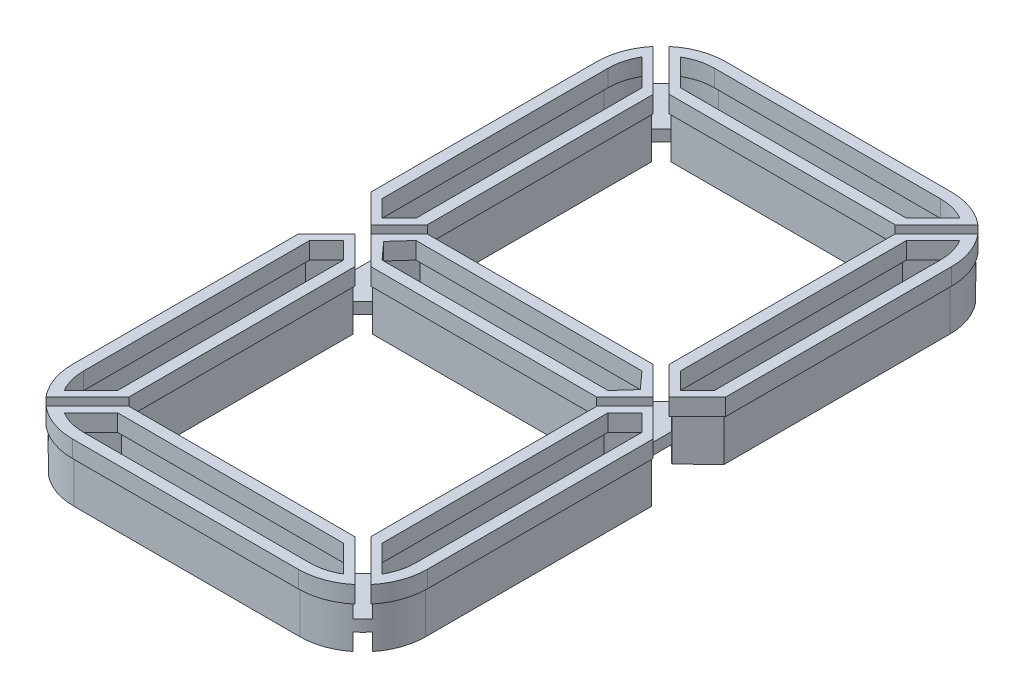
from build123d import *
from build123d.topology import SkipClean

# Parameters (mm, degrees)
SALIENTE_EXTRUIR1_DEPTH   = 4
SALIENTE_EXTRUIR2_DEPTH   = 1
CORTAR_EXTRUIR2_DEPTH     = 4
SALIENTE_EXTRUIR4_DEPTH   = 1
SALIENTE_EXTRUIR6_DEPTH   = 3
SALIENTE_EXTRUIR6_2_DEPTH = 3
SALIENTE_EXTRUIR6_3_DEPTH = 3
SALIENTE_EXTRUIR6_4_DEPTH = 3
SALIENTE_EXTRUIR6_5_DEPTH = 3
SALIENTE_EXTRUIR6_6_DEPTH = 3
CORTAR_EXTRUIR3_DEPTH     = 2
SALIENTE_EXTRUIR9_DEPTH   = 3
CORTAR_EXTRUIR4_DEPTH     = 2
SALIENTE_EXTRUIR11_DEPTH  = 3
CORTAR_EXTRUIR5_DEPTH     = 2
SALIENTE_EXTRUIR16_DEPTH  = 2
SALIENTE_EXTRUIR17_DEPTH  = 4.5
CORTAR_EXTRUIR6_DEPTH     = 4
SALIENTE_EXTRUIR18_DEPTH  = 3.5
SALIENTE_EXTRUIR19_DEPTH  = 1
SALIENTE_EXTRUIR23_DEPTH  = 3


with BuildPart() as part:
    # Croquis1 → Saliente-Extruir1 (new body)
    with BuildSketch(Plane(origin=(0, 0, 0), x_dir=(1, 0, 0), z_dir=(0, 1, 0))):
        Polygon((20, -4.7), (-20, -4.7), (-24.25, 0), (-20, 4.7), (20, 4.7), (24.25, 0), align=None)
    extrude(amount=SALIENTE_EXTRUIR1_DEPTH)

    # Croquis2 → Saliente-Extruir2 (add)
    with BuildSketch(Plane(origin=(0, 4, 0), x_dir=(1, 0, 0), z_dir=(0, 1, 0))):
        Polygon((-20, 6.7), (20, 6.7), (26.25, 0), (20, -6.7), (-20, -6.7), (-26.25, 0), align=None)
    extrude(amount=-SALIENTE_EXTRUIR2_DEPTH)

    # Croquis3 → Cortar-Extruir2 (cut)
    with BuildSketch(Plane(origin=(0, 0, 0), x_dir=(-1, 0, 0), z_dir=(0, -1, 0))):
        Polygon((23.25, 0), (20, -3.7), (-20, -3.7), (-23.25, 0), (-20, 3.7), (20, 3.7), align=None)
    extrude(amount=-CORTAR_EXTRUIR2_DEPTH, mode=Mode.SUBTRACT)

    # Croquis4 → Saliente-Extruir4 (add)
    with BuildSketch(Plane(origin=(0, 0, 0), x_dir=(-1, 0, 0), z_dir=(0, -1, 0))):
        Polygon((23.25, 0), (20, -3.7), (-20, -3.7), (-23.25, 0), (-20, 3.7), (20, 3.7), align=None)
    extrude(amount=-SALIENTE_EXTRUIR4_DEPTH)

    # Croquis13 → Saliente-Extruir16 (add)
    with BuildSketch(Plane(origin=(0, 3, 0), x_dir=(1, 0, 0), z_dir=(0, 1, 0))):
        Polygon((26.25, 0), (20, 6.7), (21.71, 6.7), (21.71, 6.41), (26.41, 1.87), (26.41, -1.87), (21.71, -6.41), (21.71, -6.7), (20, -6.7), align=None)
        with BuildLine():
            Line((21.71, 46.41), (20, 48.12))
            Line((20, 48.12), (26.954290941, 55.074290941))
            ThreePointArc((26.954290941, 55.074290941), (27.855956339, 54.265956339), (28.664290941, 53.364290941))
            Line((28.664290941, 53.364290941), (21.71, 46.41))
        make_face()
        Polygon((-26.41, -1.87), (-26.41, 1.87), (-21.71, 6.41), (-21.71, 6.7), (-20, 6.7), (-26.25, 0), (-20, -6.7), (-21.71, -6.7), (-21.71, -6.41), align=None)
        with BuildLine():
            Line((-21.71, 46.41), (-28.664290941, 53.364290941))
            ThreePointArc((-28.664290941, 53.364290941), (-27.855956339, 54.265956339), (-26.954290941, 55.074290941))
            Line((-26.954290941, 55.074290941), (-20, 48.12))
            Line((-20, 48.12), (-21.71, 46.41))
        make_face()
        with BuildLine():
            Line((-21.71, -46.41), (-20, -48.12))
            Line((-20, -48.12), (-26.954290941, -55.074290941))
            ThreePointArc((-26.954290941, -55.074290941), (-27.855956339, -54.265956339), (-28.664290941, -53.364290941))
            Line((-28.664290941, -53.364290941), (-21.71, -46.41))
        make_face()
        with BuildLine():
            Line((21.71, -46.41), (28.664290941, -53.364290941))
            ThreePointArc((28.664290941, -53.364290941), (27.855956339, -54.265956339), (26.954290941, -55.074290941))
            Line((26.954290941, -55.074290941), (20, -48.12))
            Line((20, -48.12), (21.71, -46.41))
        make_face()
    extrude(amount=SALIENTE_EXTRUIR16_DEPTH)


with BuildPart() as body_2:
    # Croquis5 → Saliente-Extruir6 (new body)
    with BuildSketch(Plane(origin=(0, 3, 0), x_dir=(-1, 0, 0), z_dir=(0, -1, 0))):
        with BuildLine():
            Line((-31.11, -6.41), (-31.11, -46.41))
            ThreePointArc((-31.11, -46.41), (-30.560340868, -49.861275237), (-28.965751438, -52.971051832))
            Line((-28.965751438, -52.971051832), (-26.41, -50.66))
            Line((-26.41, -50.66), (-21.71, -46.41))
            Line((-21.71, -46.41), (-21.71, -6.41))
            Line((-21.71, -6.41), (-26.41, -2.16))
            Line((-26.41, -2.16), (-31.11, -6.41))
        make_face()
    extrude(amount=SALIENTE_EXTRUIR6_DEPTH)


with BuildPart() as body_3:
    # Croquis5 → Saliente-Extruir6 2 (new body)
    with BuildSketch(Plane(origin=(0, 3, 0), x_dir=(-1, 0, 0), z_dir=(0, -1, 0))):
        with BuildLine():
            Line((20, -48.12), (-20, -48.12))
            Line((-20, -48.12), (-24.25, -52.82))
            Line((-24.25, -52.82), (-26.561051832, -55.375751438))
            ThreePointArc((-26.561051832, -55.375751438), (-23.451275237, -56.970340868), (-20, -57.52))
            Line((-20, -57.52), (20, -57.52))
            ThreePointArc((20, -57.52), (23.451275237, -56.970340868), (26.561051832, -55.375751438))
            Line((26.561051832, -55.375751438), (24.25, -52.82))
            Line((24.25, -52.82), (20, -48.12))
        make_face()
    extrude(amount=SALIENTE_EXTRUIR6_2_DEPTH)


with BuildPart() as body_4:
    # Croquis5 → Saliente-Extruir6 3 (new body)
    with BuildSketch(Plane(origin=(0, 3, 0), x_dir=(-1, 0, 0), z_dir=(0, -1, 0))):
        with BuildLine():
            Line((21.71, -6.41), (26.41, -2.16))
            Line((26.41, -2.16), (31.11, -6.41))
            Line((31.11, -6.41), (31.11, -46.41))
            ThreePointArc((31.11, -46.41), (30.560340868, -49.861275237), (28.965751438, -52.971051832))
            Line((28.965751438, -52.971051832), (26.41, -50.66))
            Line((26.41, -50.66), (21.71, -46.41))
            Line((21.71, -46.41), (21.71, -6.41))
        make_face()
    extrude(amount=SALIENTE_EXTRUIR6_3_DEPTH)


with BuildPart() as body_5:
    # Croquis5 → Saliente-Extruir6 4 (new body)
    with BuildSketch(Plane(origin=(0, 3, 0), x_dir=(-1, 0, 0), z_dir=(0, -1, 0))):
        with BuildLine():
            Line((21.71, 46.41), (26.41, 50.66))
            Line((26.41, 50.66), (28.965751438, 52.971051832))
            ThreePointArc((28.965751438, 52.971051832), (30.560340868, 49.861275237), (31.11, 46.41))
            Line((31.11, 46.41), (31.11, 6.41))
            Line((31.11, 6.41), (26.41, 2.16))
            Line((26.41, 2.16), (21.71, 6.41))
            Line((21.71, 6.41), (21.71, 46.41))
        make_face()
    extrude(amount=SALIENTE_EXTRUIR6_4_DEPTH)


with BuildPart() as body_6:
    # Croquis5 → Saliente-Extruir6 5 (new body)
    with BuildSketch(Plane(origin=(0, 3, 0), x_dir=(-1, 0, 0), z_dir=(0, -1, 0))):
        with BuildLine():
            Line((24.25, 52.82), (20, 48.12))
            Line((20, 48.12), (-20, 48.12))
            Line((-20, 48.12), (-24.25, 52.82))
            Line((-24.25, 52.82), (-26.561051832, 55.375751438))
            ThreePointArc((-26.561051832, 55.375751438), (-23.451275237, 56.970340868), (-20, 57.52))
            Line((-20, 57.52), (20, 57.52))
            ThreePointArc((20, 57.52), (23.451275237, 56.970340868), (26.561051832, 55.375751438))
            Line((26.561051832, 55.375751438), (24.25, 52.82))
        make_face()
    extrude(amount=SALIENTE_EXTRUIR6_5_DEPTH)


with BuildPart() as body_7:
    # Croquis5 → Saliente-Extruir6 6 (new body)
    with BuildSketch(Plane(origin=(0, 3, 0), x_dir=(-1, 0, 0), z_dir=(0, -1, 0))):
        with BuildLine():
            Line((-28.965751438, 52.971051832), (-26.41, 50.66))
            Line((-26.41, 50.66), (-21.71, 46.41))
            Line((-21.71, 46.41), (-21.71, 6.41))
            Line((-21.71, 6.41), (-26.41, 2.16))
            Line((-26.41, 2.16), (-31.11, 6.41))
            Line((-31.11, 6.41), (-31.11, 46.41))
            ThreePointArc((-31.11, 46.41), (-30.560340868, 49.861275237), (-28.965751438, 52.971051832))
        make_face()
    extrude(amount=SALIENTE_EXTRUIR6_6_DEPTH)


with BuildPart() as cortar_extruir3_tool:
    # Croquis7 → Cortar-Extruir3 (new body)
    with BuildSketch(Plane(origin=(0, 3, 0), x_dir=(1, 0, 0), z_dir=(0, 1, 0))):
        with BuildLine():
            Line((-19, 56.52), (-20, 56.52))
            ThreePointArc((-20, 56.52), (-22.635771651, 56.170369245), (-25.08923928, 55.145659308))
            Line((-25.08923928, 55.145659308), (-20, 49.12))
            Line((-20, 49.12), (-19, 49.12))
            Line((-19, 49.12), (19, 49.12))
            Line((19, 49.12), (20, 49.12))
            Line((20, 49.12), (25.08923928, 55.145659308))
            ThreePointArc((25.08923928, 55.145659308), (22.635771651, 56.170369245), (20, 56.52))
            Line((20, 56.52), (19, 56.52))
            Line((19, 56.52), (-19, 56.52))
        make_face()
        with BuildLine():
            Line((-28.656291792, 51.633094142), (-22.71, 46.41))
            Line((-22.71, 46.41), (-22.71, 45.41))
            Line((-22.71, 45.41), (-22.71, 7.41))
            Line((-22.71, 7.41), (-22.71, 6.41))
            Line((-22.71, 6.41), (-26.41, 3.064255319))
            Line((-26.41, 3.064255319), (-30.11, 6.41))
            Line((-30.11, 6.41), (-30.11, 7.41))
            Line((-30.11, 7.41), (-30.11, 45.41))
            Line((-30.11, 45.41), (-30.11, 46.41))
            ThreePointArc((-30.11, 46.41), (-29.739794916, 49.120810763), (-28.656291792, 51.633094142))
        make_face()
        with BuildLine():
            ThreePointArc((28.656291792, 51.633094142), (29.739794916, 49.120810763), (30.11, 46.41))
            Line((30.11, 46.41), (30.11, 45.41))
            Line((30.11, 45.41), (30.11, 7.41))
            Line((30.11, 7.41), (30.11, 6.41))
            Line((30.11, 6.41), (26.41, 3.064255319))
            Line((26.41, 3.064255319), (22.71, 6.41))
            Line((22.71, 6.41), (22.71, 7.41))
            Line((22.71, 7.41), (22.71, 45.41))
            Line((22.71, 45.41), (22.71, 46.41))
            Line((22.71, 46.41), (28.656291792, 51.633094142))
        make_face()
        with BuildLine():
            Line((28.656291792, -51.633094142), (22.71, -46.41))
            Line((22.71, -46.41), (22.71, -45.41))
            Line((22.71, -45.41), (22.71, -7.41))
            Line((22.71, -7.41), (22.71, -6.41))
            Line((22.71, -6.41), (26.41, -3.064255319))
            Line((26.41, -3.064255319), (30.11, -6.41))
            Line((30.11, -6.41), (30.11, -7.41))
            Line((30.11, -7.41), (30.11, -45.41))
            Line((30.11, -45.41), (30.11, -46.41))
            ThreePointArc((30.11, -46.41), (29.739794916, -49.120810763), (28.656291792, -51.633094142))
        make_face()
        with BuildLine():
            ThreePointArc((-28.656291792, -51.633094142), (-29.739794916, -49.120810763), (-30.11, -46.41))
            Line((-30.11, -46.41), (-30.11, -45.41))
            Line((-30.11, -45.41), (-30.11, -7.41))
            Line((-30.11, -7.41), (-30.11, -6.41))
            Line((-30.11, -6.41), (-26.41, -3.064255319))
            Line((-26.41, -3.064255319), (-22.71, -6.41))
            Line((-22.71, -6.41), (-22.71, -7.41))
            Line((-22.71, -7.41), (-22.71, -45.41))
            Line((-22.71, -45.41), (-22.71, -46.41))
            Line((-22.71, -46.41), (-28.656291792, -51.633094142))
        make_face()
        with BuildLine():
            Line((19, -56.52), (20, -56.52))
            ThreePointArc((20, -56.52), (22.635771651, -56.170369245), (25.08923928, -55.145659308))
            Line((25.08923928, -55.145659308), (20, -49.12))
            Line((20, -49.12), (19, -49.12))
            Line((19, -49.12), (-19, -49.12))
            Line((-19, -49.12), (-20, -49.12))
            Line((-20, -49.12), (-25.08923928, -55.145659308))
            ThreePointArc((-25.08923928, -55.145659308), (-22.635771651, -56.170369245), (-20, -56.52))
            Line((-20, -56.52), (-19, -56.52))
            Line((-19, -56.52), (19, -56.52))
        make_face()
    extrude(amount=-CORTAR_EXTRUIR3_DEPTH)


with BuildPart() as body_2_1:
    add(body_2.part)

    # Cortar-Extruir3: cut by cortar_extruir3_tool
    add(cortar_extruir3_tool.part, mode=Mode.SUBTRACT)



with BuildPart() as body_3_1:
    add(body_3.part)

    # Cortar-Extruir3: cut by cortar_extruir3_tool
    add(cortar_extruir3_tool.part, mode=Mode.SUBTRACT)


with BuildPart() as body_4_1:
    add(body_4.part)

    # Cortar-Extruir3: cut by cortar_extruir3_tool
    add(cortar_extruir3_tool.part, mode=Mode.SUBTRACT)


with BuildPart() as body_5_1:
    add(body_5.part)

    # Cortar-Extruir3: cut by cortar_extruir3_tool
    add(cortar_extruir3_tool.part, mode=Mode.SUBTRACT)


with BuildPart() as body_6_1:
    add(body_6.part)

    # Cortar-Extruir3: cut by cortar_extruir3_tool
    add(cortar_extruir3_tool.part, mode=Mode.SUBTRACT)


with BuildPart() as body_7_1:
    add(body_7.part)

    # Cortar-Extruir3: cut by cortar_extruir3_tool
    add(cortar_extruir3_tool.part, mode=Mode.SUBTRACT)


with BuildPart() as body_2_2:
    add(body_2_1.part)

    add(body_4_1.part)  # Saliente-Extruir9 merges body 4

    add(body_5_1.part)  # Saliente-Extruir9 merges body 5

    add(body_7_1.part)  # Saliente-Extruir9 merges body 7
    # Croquis8 → Saliente-Extruir9 (add)
    with BuildSketch(Plane(origin=(0, 3, 0), x_dir=(1, 0, 0), z_dir=(0, 1, 0))):
        Polygon((-26.41, 1.87), (-21.71, 6.41), (-26.41, 2.16), (-31.11, 6.41), align=None)
        Polygon((-26.41, -1.87), (-21.71, -6.41), (-26.41, -2.16), (-31.11, -6.41), align=None)
        Polygon((26.41, 1.87), (21.71, 6.41), (26.41, 2.16), (31.11, 6.41), align=None)
        Polygon((26.41, -1.87), (21.71, -6.41), (26.41, -2.16), (31.11, -6.41), align=None)
    extrude(amount=-SALIENTE_EXTRUIR9_DEPTH)

    # Croquis9 → Cortar-Extruir4 (cut)
    with BuildSketch(Plane(origin=(0, 3, 0), x_dir=(1, 0, 0), z_dir=(0, 1, 0))):
        Polygon((26.41, 2.774255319), (22.71, 6.41), (26.41, 3.064255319), (30.11, 6.41), align=None)
        Polygon((30.11, -6.41), (26.41, -2.774255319), (22.71, -6.41), (26.41, -3.064255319), align=None)
        Polygon((-26.41, -2.774255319), (-22.71, -6.41), (-26.41, -3.064255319), (-30.11, -6.41), align=None)
        Polygon((-30.11, 6.41), (-26.41, 2.774255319), (-22.71, 6.41), (-26.41, 3.064255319), align=None)
    extrude(amount=-CORTAR_EXTRUIR4_DEPTH, mode=Mode.SUBTRACT)


    add(body_3_1.part)  # Saliente-Extruir11 merges body 3

    add(body_6_1.part)  # Saliente-Extruir11 merges body 6
    # Croquis10 → Saliente-Extruir11 (add)
    with BuildSketch(Plane(origin=(0, 3, 0), x_dir=(1, 0, 0), z_dir=(0, 1, 0))):
        with BuildLine():
            Line((20, 48.12), (26.954290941, 55.074290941))
            ThreePointArc((26.954290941, 55.074290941), (26.759352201, 55.227213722), (26.561051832, 55.375751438))
            Line((26.561051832, 55.375751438), (20, 48.12))
        make_face()
        with BuildLine():
            Line((21.71, 46.41), (28.664290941, 53.364290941))
            ThreePointArc((28.664290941, 53.364290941), (28.817213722, 53.169352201), (28.965751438, 52.971051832))
            Line((28.965751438, 52.971051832), (21.71, 46.41))
        make_face()
        with BuildLine():
            Line((-21.71, 46.41), (-28.965751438, 52.971051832))
            ThreePointArc((-28.965751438, 52.971051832), (-28.817213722, 53.169352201), (-28.664290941, 53.364290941))
            Line((-28.664290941, 53.364290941), (-21.71, 46.41))
        make_face()
        with BuildLine():
            Line((-20, 48.12), (-26.561051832, 55.375751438))
            ThreePointArc((-26.561051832, 55.375751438), (-26.759352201, 55.227213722), (-26.954290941, 55.074290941))
            Line((-26.954290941, 55.074290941), (-20, 48.12))
        make_face()
        with BuildLine():
            Line((-20, -48.12), (-26.954290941, -55.074290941))
            ThreePointArc((-26.954290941, -55.074290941), (-26.759352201, -55.227213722), (-26.561051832, -55.375751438))
            Line((-26.561051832, -55.375751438), (-20, -48.12))
        make_face()
        with BuildLine():
            Line((-21.71, -46.41), (-28.664290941, -53.364290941))
            ThreePointArc((-28.664290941, -53.364290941), (-28.817213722, -53.169352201), (-28.965751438, -52.971051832))
            Line((-28.965751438, -52.971051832), (-21.71, -46.41))
        make_face()
        with BuildLine():
            Line((21.71, -46.41), (28.965751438, -52.971051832))
            ThreePointArc((28.965751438, -52.971051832), (28.817213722, -53.169352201), (28.664290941, -53.364290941))
            Line((28.664290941, -53.364290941), (21.71, -46.41))
        make_face()
        with BuildLine():
            Line((20, -48.12), (26.561051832, -55.375751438))
            ThreePointArc((26.561051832, -55.375751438), (26.759352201, -55.227213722), (26.954290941, -55.074290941))
            Line((26.954290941, -55.074290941), (20, -48.12))
        make_face()
    extrude(amount=-SALIENTE_EXTRUIR11_DEPTH)

    # Croquis11 → Cortar-Extruir5 (cut)
    with BuildSketch(Plane(origin=(0, 3, 0), x_dir=(1, 0, 0), z_dir=(0, 1, 0))):
        with BuildLine():
            Line((28.374261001, 52.074261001), (22.71, 46.41))
            Line((22.71, 46.41), (28.656291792, 51.633094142))
            ThreePointArc((28.656291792, 51.633094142), (28.518132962, 51.855503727), (28.374261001, 52.074261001))
        make_face()
        with BuildLine():
            Line((25.08923928, 55.145659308), (20, 49.12))
            Line((20, 49.12), (25.664261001, 54.784261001))
            ThreePointArc((25.664261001, 54.784261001), (25.379785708, 54.969790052), (25.08923928, 55.145659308))
        make_face()
        with BuildLine():
            ThreePointArc((-28.374261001, 52.074261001), (-28.518132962, 51.855503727), (-28.656291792, 51.633094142))
            Line((-28.656291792, 51.633094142), (-22.71, 46.41))
            Line((-22.71, 46.41), (-28.374261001, 52.074261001))
        make_face()
        with BuildLine():
            Line((-20, 49.12), (-25.08923928, 55.145659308))
            ThreePointArc((-25.08923928, 55.145659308), (-25.379785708, 54.969790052), (-25.664261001, 54.784261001))
            Line((-25.664261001, 54.784261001), (-20, 49.12))
        make_face()
        with BuildLine():
            Line((-28.374261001, -52.074261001), (-22.71, -46.41))
            Line((-22.71, -46.41), (-28.656291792, -51.633094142))
            ThreePointArc((-28.656291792, -51.633094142), (-28.518132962, -51.855503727), (-28.374261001, -52.074261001))
        make_face()
        with BuildLine():
            Line((-25.08923928, -55.145659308), (-20, -49.12))
            Line((-20, -49.12), (-25.664261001, -54.784261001))
            ThreePointArc((-25.664261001, -54.784261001), (-25.379785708, -54.969790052), (-25.08923928, -55.145659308))
        make_face()
        with BuildLine():
            ThreePointArc((28.374261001, -52.074261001), (28.518132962, -51.855503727), (28.656291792, -51.633094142))
            Line((28.656291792, -51.633094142), (22.71, -46.41))
            Line((22.71, -46.41), (28.374261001, -52.074261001))
        make_face()
        with BuildLine():
            Line((20, -49.12), (25.08923928, -55.145659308))
            ThreePointArc((25.08923928, -55.145659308), (25.379785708, -54.969790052), (25.664261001, -54.784261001))
            Line((25.664261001, -54.784261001), (20, -49.12))
        make_face()
    extrude(amount=-CORTAR_EXTRUIR5_DEPTH, mode=Mode.SUBTRACT)



with BuildPart() as saliente_extruir16_piece_1:
    # of the separate pieces the step leaves, piece 1, a body of its own (saliente_extruir16_pieces)
    add(part.part.solids().sort_by_distance((20, 0, 4.7))[0])


with BuildPart() as saliente_extruir16_piece_2:
    # of the separate pieces the step leaves, piece 2, a body of its own (saliente_extruir16_pieces)
    add(part.part.solids().sort_by_distance((-21.71, 3, 46.41))[0])


with BuildPart() as saliente_extruir16_piece_3:
    # of the separate pieces the step leaves, piece 3, a body of its own (saliente_extruir16_pieces)
    add(part.part.solids().sort_by_distance((-21.71, 3, -46.41))[0])


with BuildPart() as saliente_extruir16_piece_4:
    # of the separate pieces the step leaves, piece 4, a body of its own (saliente_extruir16_pieces)
    add(part.part.solids().sort_by_distance((26.954290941, 3, -55.074290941))[0])


with BuildPart() as saliente_extruir16_piece_5:
    # of the separate pieces the step leaves, piece 5, a body of its own (saliente_extruir16_pieces)
    add(part.part.solids().sort_by_distance((26.954290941, 3, 55.074290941))[0])


with BuildPart() as body_2_3:
    with SkipClean():  # the faces are left unmerged after this step: merging them gives an invalid solid
        add(body_2_2.part)

        add(saliente_extruir16_piece_1.part)  # Saliente-Extruir17 merges Saliente-Extruir16 piece 1

        add(saliente_extruir16_piece_2.part)  # Saliente-Extruir17 merges Saliente-Extruir16 piece 2

        add(saliente_extruir16_piece_3.part)  # Saliente-Extruir17 merges Saliente-Extruir16 piece 3

        add(saliente_extruir16_piece_4.part)  # Saliente-Extruir17 merges Saliente-Extruir16 piece 4

        add(saliente_extruir16_piece_5.part)  # Saliente-Extruir17 merges Saliente-Extruir16 piece 5
        # Croquis16 → Saliente-Extruir17 (add)
        # profile 1 of 6: a face of its own
        with BuildSketch(Plane(origin=(0, 3, 0), x_dir=(1, 0, 0), z_dir=(0, 1, 0))):
            with BuildLine():
                Line((-21.71, -6.41), (-26.41, -1.87))
                Line((-26.41, -1.87), (-31.11, -6.41))
                Line((-31.11, -6.41), (-31.11, -46.41))
                ThreePointArc((-31.11, -46.41), (-30.48075313, -50.095907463), (-28.664290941, -53.364290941))
                Line((-28.664290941, -53.364290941), (-21.71, -46.41))
                Line((-21.71, -46.41), (-21.71, -6.41))
            make_face()
            with BuildLine():
                Line((-30.11, -6.41), (-26.41, -2.774255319))
                Line((-26.41, -2.774255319), (-22.71, -6.41))
                Line((-22.71, -6.41), (-22.71, -46.41))
                Line((-22.71, -46.41), (-28.374261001, -52.074261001))
                ThreePointArc((-28.374261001, -52.074261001), (-29.666330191, -49.37212097), (-30.11, -46.41))
                Line((-30.11, -46.41), (-30.11, -6.41))
            make_face(mode=Mode.SUBTRACT)
        # profile 2 of 6: a face of its own
        with BuildSketch(Plane(origin=(0, 3, 0), x_dir=(1, 0, 0), z_dir=(0, 1, 0))):
            with BuildLine():
                Line((20, -48.12), (-20, -48.12))
                Line((-20, -48.12), (-26.954290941, -55.074290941))
                ThreePointArc((-26.954290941, -55.074290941), (-23.685907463, -56.89075313), (-20, -57.52))
                Line((-20, -57.52), (20, -57.52))
                ThreePointArc((20, -57.52), (23.685907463, -56.89075313), (26.954290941, -55.074290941))
                Line((26.954290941, -55.074290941), (20, -48.12))
            make_face()
            with BuildLine():
                Line((-25.664261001, -54.784261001), (-20, -49.12))
                Line((-20, -49.12), (20, -49.12))
                Line((20, -49.12), (25.664261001, -54.784261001))
                ThreePointArc((25.664261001, -54.784261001), (22.96212097, -56.076330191), (20, -56.52))
                Line((20, -56.52), (-20, -56.52))
                ThreePointArc((-20, -56.52), (-22.96212097, -56.076330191), (-25.664261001, -54.784261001))
            make_face(mode=Mode.SUBTRACT)
        # profile 3 of 6: a face of its own
        with BuildSketch(Plane(origin=(0, 3, 0), x_dir=(1, 0, 0), z_dir=(0, 1, 0))):
            with BuildLine():
                Line((21.71, -6.41), (21.71, -46.41))
                Line((21.71, -46.41), (28.664290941, -53.364290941))
                ThreePointArc((28.664290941, -53.364290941), (30.48075313, -50.095907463), (31.11, -46.41))
                Line((31.11, -46.41), (31.11, -6.41))
                Line((31.11, -6.41), (26.41, -1.87))
                Line((26.41, -1.87), (21.71, -6.41))
            make_face()
            with BuildLine():
                Line((28.374261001, -52.074261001), (22.71, -46.41))
                Line((22.71, -46.41), (22.71, -6.41))
                Line((22.71, -6.41), (26.41, -2.774255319))
                Line((26.41, -2.774255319), (30.11, -6.41))
                Line((30.11, -6.41), (30.11, -46.41))
                ThreePointArc((30.11, -46.41), (29.666330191, -49.37212097), (28.374261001, -52.074261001))
            make_face(mode=Mode.SUBTRACT)
        # profile 4 of 6: a face of its own
        with BuildSketch(Plane(origin=(0, 3, 0), x_dir=(1, 0, 0), z_dir=(0, 1, 0))):
            with BuildLine():
                Line((21.71, 6.41), (26.41, 1.87))
                Line((26.41, 1.87), (31.11, 6.41))
                Line((31.11, 6.41), (31.11, 46.41))
                ThreePointArc((31.11, 46.41), (30.48075313, 50.095907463), (28.664290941, 53.364290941))
                Line((28.664290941, 53.364290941), (21.71, 46.41))
                Line((21.71, 46.41), (21.71, 6.41))
            make_face()
            with BuildLine():
                Line((30.11, 6.41), (26.41, 2.774255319))
                Line((26.41, 2.774255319), (22.71, 6.41))
                Line((22.71, 6.41), (22.71, 46.41))
                Line((22.71, 46.41), (28.374261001, 52.074261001))
                ThreePointArc((28.374261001, 52.074261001), (29.666330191, 49.37212097), (30.11, 46.41))
                Line((30.11, 46.41), (30.11, 6.41))
            make_face(mode=Mode.SUBTRACT)
        # profile 5 of 6: a face of its own
        with BuildSketch(Plane(origin=(0, 3, 0), x_dir=(1, 0, 0), z_dir=(0, 1, 0))):
            with BuildLine():
                Line((-20, 48.12), (20, 48.12))
                Line((20, 48.12), (26.954290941, 55.074290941))
                ThreePointArc((26.954290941, 55.074290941), (23.685907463, 56.89075313), (20, 57.52))
                Line((20, 57.52), (-20, 57.52))
                ThreePointArc((-20, 57.52), (-23.685907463, 56.89075313), (-26.954290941, 55.074290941))
                Line((-26.954290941, 55.074290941), (-20, 48.12))
            make_face()
            with BuildLine():
                Line((-20, 49.12), (-25.664261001, 54.784261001))
                ThreePointArc((-25.664261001, 54.784261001), (-22.96212097, 56.076330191), (-20, 56.52))
                Line((-20, 56.52), (20, 56.52))
                ThreePointArc((20, 56.52), (22.96212097, 56.076330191), (25.664261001, 54.784261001))
                Line((25.664261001, 54.784261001), (20, 49.12))
                Line((20, 49.12), (-20, 49.12))
            make_face(mode=Mode.SUBTRACT)
        # profile 6 of 6: a face of its own
        with BuildSketch(Plane(origin=(0, 3, 0), x_dir=(1, 0, 0), z_dir=(0, 1, 0))):
            with BuildLine():
                Line((-31.11, 46.41), (-31.11, 6.41))
                Line((-31.11, 6.41), (-26.41, 1.87))
                Line((-26.41, 1.87), (-21.71, 6.41))
                Line((-21.71, 6.41), (-21.71, 46.41))
                Line((-21.71, 46.41), (-28.664290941, 53.364290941))
                ThreePointArc((-28.664290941, 53.364290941), (-30.48075313, 50.095907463), (-31.11, 46.41))
            make_face()
            with BuildLine():
                Line((-28.374261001, 52.074261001), (-22.71, 46.41))
                Line((-22.71, 46.41), (-22.71, 6.41))
                Line((-22.71, 6.41), (-26.41, 2.774255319))
                Line((-26.41, 2.774255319), (-30.11, 6.41))
                Line((-30.11, 6.41), (-30.11, 46.41))
                ThreePointArc((-30.11, 46.41), (-29.666330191, 49.37212097), (-28.374261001, 52.074261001))
            make_face(mode=Mode.SUBTRACT)
        extrude(amount=SALIENTE_EXTRUIR17_DEPTH)

    # Croquis17 → Cortar-Extruir6 (cut)
    with SkipClean():  # the faces are left unmerged after this step: merging them gives an invalid solid
        with BuildSketch(Plane.XZ.offset(-3)):
            Polygon((-21.71, 6.41), (-20, 4.7), (20, 4.7), (21.71, 6.41), (21.71, 6.7), (-21.71, 6.7), align=None)
            Polygon((-21.71, -6.7), (-21.71, -6.41), (-20, -4.7), (20, -4.7), (21.71, -6.41), (21.71, -6.7), align=None)
        extrude(amount=-CORTAR_EXTRUIR6_DEPTH, mode=Mode.SUBTRACT)

    # Croquis18 → Saliente-Extruir18 (add)
    with SkipClean():  # the faces are left unmerged after this step: merging them gives an invalid solid
        with BuildSketch(Plane(origin=(0, 4, 0), x_dir=(1, 0, 0), z_dir=(0, 1, 0))):
            Polygon((24.25, 0), (20, 4.7), (-20, 4.7), (-24.25, 0), (-20, -4.7), (20, -4.7), align=None)
            Polygon((23.25, 0), (20, -3.7), (-20, -3.7), (-23.25, 0), (-20, 3.7), (20, 3.7), align=None, mode=Mode.SUBTRACT)
        extrude(amount=SALIENTE_EXTRUIR18_DEPTH)

    # Croquis19 → Saliente-Extruir19 (add)
    with SkipClean():  # the faces are left unmerged after this step: merging them gives an invalid solid
        with BuildSketch(Plane(origin=(0, 4, 0), x_dir=(1, 0, 0), z_dir=(0, 1, 0))):
            Polygon((-20, 4.7), (-20.965250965, 5.665250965), (-26.25, 0), (-20.965250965, -5.665250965), (-20, -4.7), (-24.25, 0), align=None)
            Polygon((20, 4.7), (20.965250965, 5.665250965), (26.25, 0), (20.965250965, -5.665250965), (20, -4.7), (24.25, 0), align=None)
        extrude(amount=SALIENTE_EXTRUIR19_DEPTH)

    # Croquis22 → Saliente-Extruir23 (add)
    # profile 1 of 7: a face of its own
    with SkipClean():  # the faces are left unmerged after this step: merging them gives an invalid solid
        with BuildSketch(Plane(origin=(0, 7.5, 0), x_dir=(1, 0, 0), z_dir=(0, 1, 0))):
            with BuildLine():
                Line((-21.41, 6.41), (-21.41, 46.41))
                Line((-21.41, 46.41), (-28.742227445, 53.742227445))
                ThreePointArc((-28.742227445, 53.742227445), (-30.722334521, 50.311236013), (-31.41, 46.41))
                Line((-31.41, 46.41), (-31.41, 6.41))
                Line((-31.41, 6.41), (-26.41, 1.41))
                Line((-26.41, 1.41), (-21.41, 6.41))
            make_face()
            with BuildLine():
                Line((-26.41, 3.41), (-29.41, 6.41))
                Line((-29.41, 6.41), (-29.41, 46.41))
                ThreePointArc((-29.41, 46.41), (-29.086105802, 48.857607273), (-28.136720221, 51.136720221))
                Line((-28.136720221, 51.136720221), (-23.41, 46.41))
                Line((-23.41, 46.41), (-23.41, 6.41))
                Line((-23.41, 6.41), (-26.41, 3.41))
            make_face(mode=Mode.SUBTRACT)
        # profile 2 of 7: a face of its own
        with BuildSketch(Plane(origin=(0, 7.5, 0), x_dir=(1, 0, 0), z_dir=(0, 1, 0))):
            with BuildLine():
                Line((21.41, 6.41), (26.41, 1.41))
                Line((26.41, 1.41), (31.41, 6.41))
                Line((31.41, 6.41), (31.41, 46.41))
                ThreePointArc((31.41, 46.41), (30.722334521, 50.311236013), (28.742227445, 53.742227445))
                Line((28.742227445, 53.742227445), (21.41, 46.41))
                Line((21.41, 46.41), (21.41, 6.41))
            make_face()
            with BuildLine():
                Line((29.41, 46.41), (29.41, 6.41))
                Line((29.41, 6.41), (26.41, 3.41))
                Line((26.41, 3.41), (23.41, 6.41))
                Line((23.41, 6.41), (23.41, 46.41))
                Line((23.41, 46.41), (28.136720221, 51.136720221))
                ThreePointArc((28.136720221, 51.136720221), (29.086105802, 48.857607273), (29.41, 46.41))
            make_face(mode=Mode.SUBTRACT)
        # profile 3 of 7: a face of its own
        with BuildSketch(Plane(origin=(0, 7.5, 0), x_dir=(1, 0, 0), z_dir=(0, 1, 0))):
            with BuildLine():
                Line((20, 57.82), (-20, 57.82))
                ThreePointArc((-20, 57.82), (-23.901236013, 57.132334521), (-27.332227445, 55.152227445))
                Line((-27.332227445, 55.152227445), (-20, 47.82))
                Line((-20, 47.82), (20, 47.82))
                Line((20, 47.82), (27.332227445, 55.152227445))
                ThreePointArc((27.332227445, 55.152227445), (23.901236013, 57.132334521), (20, 57.82))
            make_face()
            with BuildLine():
                Line((24.726720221, 54.546720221), (20, 49.82))
                Line((20, 49.82), (-20, 49.82))
                Line((-20, 49.82), (-24.726720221, 54.546720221))
                ThreePointArc((-24.726720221, 54.546720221), (-22.447607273, 55.496105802), (-20, 55.82))
                Line((-20, 55.82), (20, 55.82))
                ThreePointArc((20, 55.82), (22.447607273, 55.496105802), (24.726720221, 54.546720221))
            make_face(mode=Mode.SUBTRACT)
        # profile 4 of 7: a face of its own
        with BuildSketch(Plane(origin=(0, 7.5, 0), x_dir=(1, 0, 0), z_dir=(0, 1, 0))):
            Polygon((25, 0), (20, 5), (-20, 5), (-25, 0), (-20, -5), (20, -5), align=None)
            Polygon((22.71, 0), (20, -3), (-20, -3), (-22.71, 0), (-20, 3), (20, 3), align=None, mode=Mode.SUBTRACT)
        # profile 5 of 7: a face of its own
        with BuildSketch(Plane(origin=(0, 7.5, 0), x_dir=(1, 0, 0), z_dir=(0, 1, 0))):
            with BuildLine():
                Line((20, -47.82), (-20, -47.82))
                Line((-20, -47.82), (-27.332227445, -55.152227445))
                ThreePointArc((-27.332227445, -55.152227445), (-23.901236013, -57.132334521), (-20, -57.82))
                Line((-20, -57.82), (20, -57.82))
                ThreePointArc((20, -57.82), (23.901236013, -57.132334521), (27.332227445, -55.152227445))
                Line((27.332227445, -55.152227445), (20, -47.82))
            make_face()
            with BuildLine():
                Line((-24.726720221, -54.546720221), (-20, -49.82))
                Line((-20, -49.82), (20, -49.82))
                Line((20, -49.82), (24.726720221, -54.546720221))
                ThreePointArc((24.726720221, -54.546720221), (22.447607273, -55.496105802), (20, -55.82))
                Line((20, -55.82), (-20, -55.82))
                ThreePointArc((-20, -55.82), (-22.447607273, -55.496105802), (-24.726720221, -54.546720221))
            make_face(mode=Mode.SUBTRACT)
        # profile 6 of 7: a face of its own
        with BuildSketch(Plane(origin=(0, 7.5, 0), x_dir=(1, 0, 0), z_dir=(0, 1, 0))):
            with BuildLine():
                Line((-21.41, -6.41), (-26.41, -1.41))
                Line((-26.41, -1.41), (-31.41, -6.41))
                Line((-31.41, -6.41), (-31.41, -46.41))
                ThreePointArc((-31.41, -46.41), (-30.722334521, -50.311236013), (-28.742227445, -53.742227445))
                Line((-28.742227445, -53.742227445), (-21.41, -46.41))
                Line((-21.41, -46.41), (-21.41, -6.41))
            make_face()
            with BuildLine():
                Line((-29.41, -46.41), (-29.41, -6.41))
                Line((-29.41, -6.41), (-26.41, -3.41))
                Line((-26.41, -3.41), (-23.41, -6.41))
                Line((-23.41, -6.41), (-23.41, -46.41))
                Line((-23.41, -46.41), (-28.136720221, -51.136720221))
                ThreePointArc((-28.136720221, -51.136720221), (-29.086105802, -48.857607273), (-29.41, -46.41))
            make_face(mode=Mode.SUBTRACT)
        # profile 7 of 7: a face of its own
        with BuildSketch(Plane(origin=(0, 7.5, 0), x_dir=(1, 0, 0), z_dir=(0, 1, 0))):
            with BuildLine():
                Line((21.41, -6.41), (21.41, -46.41))
                Line((21.41, -46.41), (28.742227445, -53.742227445))
                ThreePointArc((28.742227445, -53.742227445), (30.722334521, -50.311236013), (31.41, -46.41))
                Line((31.41, -46.41), (31.41, -6.41))
                Line((31.41, -6.41), (26.41, -1.41))
                Line((26.41, -1.41), (21.41, -6.41))
            make_face()
            with BuildLine():
                Line((23.41, -6.41), (26.41, -3.41))
                Line((26.41, -3.41), (29.41, -6.41))
                Line((29.41, -6.41), (29.41, -46.41))
                ThreePointArc((29.41, -46.41), (29.086105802, -48.857607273), (28.136720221, -51.136720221))
                Line((28.136720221, -51.136720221), (23.41, -46.41))
                Line((23.41, -46.41), (23.41, -6.41))
            make_face(mode=Mode.SUBTRACT)
        extrude(amount=SALIENTE_EXTRUIR23_DEPTH)


solid = body_2_3.part
